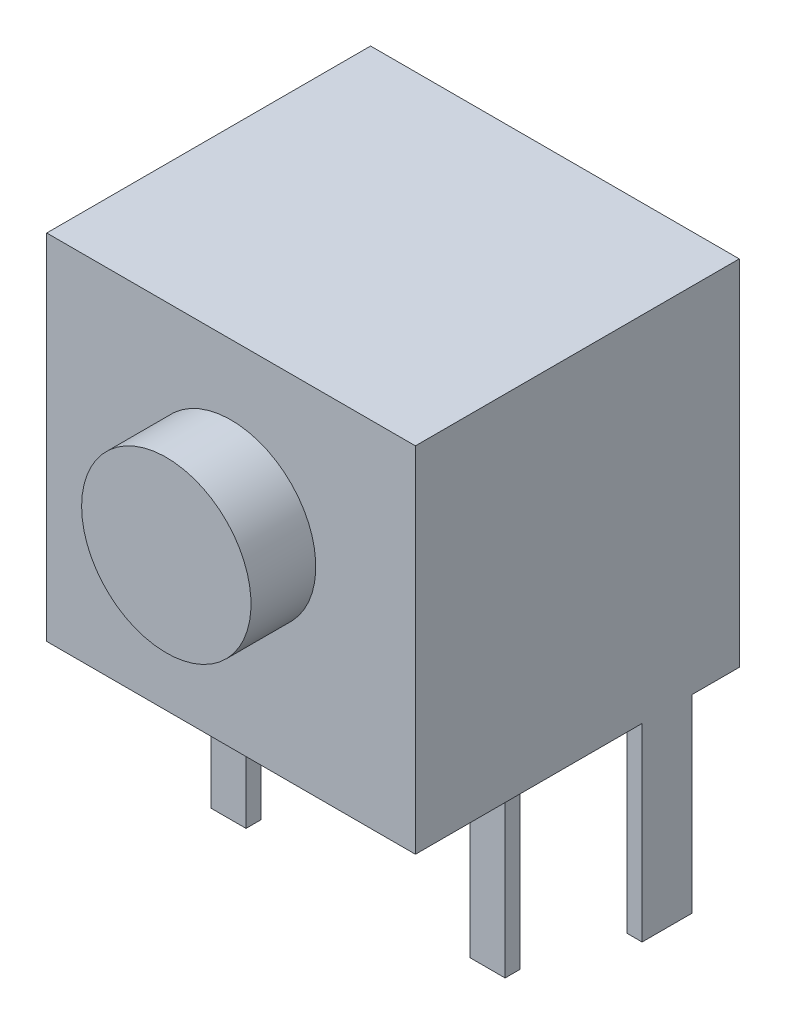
ISO-10303-21;
HEADER;
FILE_DESCRIPTION(('STEP AP214'),'2;1');
FILE_NAME('part.step','',(''),(''),'','','');
FILE_SCHEMA(('AUTOMOTIVE_DESIGN { 1 0 10303 214 1 1 1 1 }'));
ENDSEC;
DATA;
#1=APPLICATION_CONTEXT('core data for automotive mechanical design processes');
#2=APPLICATION_PROTOCOL_DEFINITION('international standard','automotive_design',2000,#1);
#3=PRODUCT_CONTEXT('',#1,'mechanical');
#4=PRODUCT('Part','Part','',(#3));
#5=PRODUCT_RELATED_PRODUCT_CATEGORY('part','',(#4));
#6=PRODUCT_DEFINITION_FORMATION('','',#4);
#7=PRODUCT_DEFINITION_CONTEXT('part definition',#1,'design');
#8=PRODUCT_DEFINITION('design','',#6,#7);
#9=PRODUCT_DEFINITION_SHAPE('','',#8);
#10=(LENGTH_UNIT() NAMED_UNIT(*) SI_UNIT(.MILLI.,.METRE.));
#11=(NAMED_UNIT(*) PLANE_ANGLE_UNIT() SI_UNIT($,.RADIAN.));
#12=(NAMED_UNIT(*) SI_UNIT($,.STERADIAN.) SOLID_ANGLE_UNIT());
#13=UNCERTAINTY_MEASURE_WITH_UNIT(LENGTH_MEASURE(1.E-05),#10,'distance_accuracy_value','');
#14=(GEOMETRIC_REPRESENTATION_CONTEXT(3) GLOBAL_UNCERTAINTY_ASSIGNED_CONTEXT((#13)) GLOBAL_UNIT_ASSIGNED_CONTEXT((#10,
#11,#12)) REPRESENTATION_CONTEXT('',''));
#15=CARTESIAN_POINT('',(0.,0.,0.));
#16=DIRECTION('',(0.,0.,1.));
#17=DIRECTION('',(1.,0.,0.));
#18=AXIS2_PLACEMENT_3D('',#15,#16,#17);
#19=CARTESIAN_POINT('',(-2.24999999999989,-7.35000000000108,-2.54999999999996));
#20=DIRECTION('',(0.,0.,-1.));
#21=DIRECTION('',(-1.,0.,0.));
#22=AXIS2_PLACEMENT_3D('',#19,#20,#21);
#23=PLANE('',#22);
#24=DIRECTION('',(0.,1.,0.));
#25=VECTOR('',#24,1.);
#26=CARTESIAN_POINT('',(-2.24999999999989,-7.35000000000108,-2.54999999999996));
#27=LINE('',#26,#25);
#28=CARTESIAN_POINT('',(-2.24999999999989,-7.35000000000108,-2.54999999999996));
#29=VERTEX_POINT('',#28);
#30=CARTESIAN_POINT('',(-2.24999999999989,-3.55000000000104,-2.54999999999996));
#31=VERTEX_POINT('',#30);
#32=EDGE_CURVE('E167',#29,#31,#27,.T.);
#33=ORIENTED_EDGE('',*,*,#32,.T.);
#34=DIRECTION('',(-1.,0.,0.));
#35=VECTOR('',#34,1.);
#36=CARTESIAN_POINT('',(-2.24999999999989,-3.55000000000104,-2.54999999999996));
#37=LINE('',#36,#35);
#38=CARTESIAN_POINT('',(-2.9500000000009,-3.55000000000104,-2.54999999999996));
#39=VERTEX_POINT('',#38);
#40=EDGE_CURVE('E151',#39,#31,#37,.F.);
#41=ORIENTED_EDGE('',*,*,#40,.F.);
#42=DIRECTION('',(0.,1.,0.));
#43=VECTOR('',#42,1.);
#44=CARTESIAN_POINT('',(-2.9500000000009,-7.35000000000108,-2.54999999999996));
#45=LINE('',#44,#43);
#46=CARTESIAN_POINT('',(-2.9500000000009,-7.35000000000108,-2.54999999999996));
#47=VERTEX_POINT('',#46);
#48=EDGE_CURVE('E253',#39,#47,#45,.F.);
#49=ORIENTED_EDGE('',*,*,#48,.T.);
#50=DIRECTION('',(-1.,0.,0.));
#51=VECTOR('',#50,1.);
#52=CARTESIAN_POINT('',(-2.24999999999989,-7.35000000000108,-2.54999999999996));
#53=LINE('',#52,#51);
#54=EDGE_CURVE('E161',#29,#47,#53,.T.);
#55=ORIENTED_EDGE('',*,*,#54,.F.);
#56=EDGE_LOOP('',(#33,#41,#49,#55));
#57=FACE_BOUND('',#56,.T.);
#58=ADVANCED_FACE('F17',(#57),#23,.F.);
#59=CARTESIAN_POINT('',(2.9500000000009,-7.35000000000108,-2.54999999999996));
#60=DIRECTION('',(0.,0.,-1.));
#61=DIRECTION('',(-1.,0.,0.));
#62=AXIS2_PLACEMENT_3D('',#59,#60,#61);
#63=PLANE('',#62);
#64=DIRECTION('',(0.,1.,0.));
#65=VECTOR('',#64,1.);
#66=CARTESIAN_POINT('',(2.9500000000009,-7.35000000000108,-2.54999999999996));
#67=LINE('',#66,#65);
#68=CARTESIAN_POINT('',(2.9500000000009,-7.35000000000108,-2.54999999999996));
#69=VERTEX_POINT('',#68);
#70=CARTESIAN_POINT('',(2.9500000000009,-3.55000000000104,-2.54999999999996));
#71=VERTEX_POINT('',#70);
#72=EDGE_CURVE('E245',#69,#71,#67,.T.);
#73=ORIENTED_EDGE('',*,*,#72,.T.);
#74=DIRECTION('',(-1.,0.,0.));
#75=VECTOR('',#74,1.);
#76=CARTESIAN_POINT('',(2.9500000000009,-3.55000000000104,-2.54999999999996));
#77=LINE('',#76,#75);
#78=CARTESIAN_POINT('',(2.24999999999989,-3.55000000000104,-2.54999999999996));
#79=VERTEX_POINT('',#78);
#80=EDGE_CURVE('E179',#79,#71,#77,.F.);
#81=ORIENTED_EDGE('',*,*,#80,.F.);
#82=DIRECTION('',(0.,1.,0.));
#83=VECTOR('',#82,1.);
#84=CARTESIAN_POINT('',(2.24999999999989,-7.35000000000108,-2.54999999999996));
#85=LINE('',#84,#83);
#86=CARTESIAN_POINT('',(2.24999999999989,-7.35000000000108,-2.54999999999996));
#87=VERTEX_POINT('',#86);
#88=EDGE_CURVE('E237',#79,#87,#85,.F.);
#89=ORIENTED_EDGE('',*,*,#88,.T.);
#90=DIRECTION('',(-1.,0.,0.));
#91=VECTOR('',#90,1.);
#92=CARTESIAN_POINT('',(2.9500000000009,-7.35000000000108,-2.54999999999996));
#93=LINE('',#92,#91);
#94=EDGE_CURVE('E174',#69,#87,#93,.T.);
#95=ORIENTED_EDGE('',*,*,#94,.F.);
#96=EDGE_LOOP('',(#73,#81,#89,#95));
#97=FACE_BOUND('',#96,.T.);
#98=ADVANCED_FACE('F428',(#97),#63,.F.);
#99=CARTESIAN_POINT('',(0.,0.449999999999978,1.29999999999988));
#100=DIRECTION('',(0.,0.,1.));
#101=DIRECTION('',(1.,0.,0.));
#102=AXIS2_PLACEMENT_3D('',#99,#100,#101);
#103=PLANE('',#102);
#104=CARTESIAN_POINT('',(0.,0.449999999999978,1.29999999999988));
#105=DIRECTION('',(0.,0.,-1.));
#106=DIRECTION('',(-1.,0.,0.));
#107=AXIS2_PLACEMENT_3D('',#104,#105,#106);
#108=CIRCLE('',#107,1.70000000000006);
#109=CARTESIAN_POINT('',(-1.70000000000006,0.449999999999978,1.29999999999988));
#110=VERTEX_POINT('',#109);
#111=EDGE_CURVE('E20',#110,#110,#108,.T.);
#112=ORIENTED_EDGE('',*,*,#111,.F.);
#113=EDGE_LOOP('',(#112));
#114=FACE_BOUND('',#113,.T.);
#115=ADVANCED_FACE('F425',(#114),#103,.T.);
#116=CARTESIAN_POINT('',(-3.3999999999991,-7.35000000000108,-4.54999999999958));
#117=DIRECTION('',(-1.,0.,0.));
#118=DIRECTION('',(0.,0.,1.));
#119=AXIS2_PLACEMENT_3D('',#116,#117,#118);
#120=PLANE('',#119);
#121=DIRECTION('',(0.,1.,0.));
#122=VECTOR('',#121,1.);
#123=CARTESIAN_POINT('',(-3.3999999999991,-7.35000000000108,-5.55000000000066));
#124=LINE('',#123,#122);
#125=CARTESIAN_POINT('',(-3.3999999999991,-7.35000000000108,-5.55000000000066));
#126=VERTEX_POINT('',#125);
#127=CARTESIAN_POINT('',(-3.3999999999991,-3.55000000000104,-5.55000000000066));
#128=VERTEX_POINT('',#127);
#129=EDGE_CURVE('E226',#126,#128,#124,.T.);
#130=ORIENTED_EDGE('',*,*,#129,.T.);
#131=DIRECTION('',(0.,0.,1.));
#132=VECTOR('',#131,1.);
#133=CARTESIAN_POINT('',(-3.3999999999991,-3.55000000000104,-4.54999999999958));
#134=LINE('',#133,#132);
#135=CARTESIAN_POINT('',(-3.3999999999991,-3.55000000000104,-4.54999999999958));
#136=VERTEX_POINT('',#135);
#137=EDGE_CURVE('E172',#136,#128,#134,.F.);
#138=ORIENTED_EDGE('',*,*,#137,.F.);
#139=DIRECTION('',(0.,1.,0.));
#140=VECTOR('',#139,1.);
#141=CARTESIAN_POINT('',(-3.3999999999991,-7.35000000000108,-4.54999999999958));
#142=LINE('',#141,#140);
#143=CARTESIAN_POINT('',(-3.3999999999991,-7.35000000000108,-4.54999999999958));
#144=VERTEX_POINT('',#143);
#145=EDGE_CURVE('E213',#136,#144,#142,.F.);
#146=ORIENTED_EDGE('',*,*,#145,.T.);
#147=DIRECTION('',(0.,0.,-1.));
#148=VECTOR('',#147,1.);
#149=CARTESIAN_POINT('',(-3.3999999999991,-7.35000000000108,-5.55000000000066));
#150=LINE('',#149,#148);
#151=EDGE_CURVE('E219',#126,#144,#150,.F.);
#152=ORIENTED_EDGE('',*,*,#151,.F.);
#153=EDGE_LOOP('',(#130,#138,#146,#152));
#154=FACE_BOUND('',#153,.T.);
#155=ADVANCED_FACE('F422',(#154),#120,.F.);
#156=CARTESIAN_POINT('',(-2.24999999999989,-7.35000000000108,-2.54999999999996));
#157=DIRECTION('',(-1.,0.,0.));
#158=DIRECTION('',(0.,0.,1.));
#159=AXIS2_PLACEMENT_3D('',#156,#157,#158);
#160=PLANE('',#159);
#161=DIRECTION('',(0.,1.,0.));
#162=VECTOR('',#161,1.);
#163=CARTESIAN_POINT('',(-2.24999999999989,-7.35000000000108,-2.84999999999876));
#164=LINE('',#163,#162);
#165=CARTESIAN_POINT('',(-2.24999999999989,-7.35000000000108,-2.84999999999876));
#166=VERTEX_POINT('',#165);
#167=CARTESIAN_POINT('',(-2.24999999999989,-3.55000000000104,-2.84999999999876));
#168=VERTEX_POINT('',#167);
#169=EDGE_CURVE('E169',#166,#168,#164,.T.);
#170=ORIENTED_EDGE('',*,*,#169,.T.);
#171=DIRECTION('',(0.,0.,1.));
#172=VECTOR('',#171,1.);
#173=CARTESIAN_POINT('',(-2.24999999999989,-3.55000000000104,-2.54999999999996));
#174=LINE('',#173,#172);
#175=EDGE_CURVE('E158',#31,#168,#174,.F.);
#176=ORIENTED_EDGE('',*,*,#175,.F.);
#177=ORIENTED_EDGE('',*,*,#32,.F.);
#178=DIRECTION('',(0.,0.,1.));
#179=VECTOR('',#178,1.);
#180=CARTESIAN_POINT('',(-2.24999999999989,-7.35000000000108,-2.84999999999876));
#181=LINE('',#180,#179);
#182=EDGE_CURVE('E251',#29,#166,#181,.F.);
#183=ORIENTED_EDGE('',*,*,#182,.T.);
#184=EDGE_LOOP('',(#170,#176,#177,#183));
#185=FACE_BOUND('',#184,.T.);
#186=ADVANCED_FACE('F165',(#185),#160,.F.);
#187=CARTESIAN_POINT('',(-2.9500000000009,-7.35000000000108,-2.54999999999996));
#188=DIRECTION('',(1.,0.,0.));
#189=DIRECTION('',(0.,0.,-1.));
#190=AXIS2_PLACEMENT_3D('',#187,#188,#189);
#191=PLANE('',#190);
#192=ORIENTED_EDGE('',*,*,#48,.F.);
#193=DIRECTION('',(0.,0.,-1.));
#194=VECTOR('',#193,1.);
#195=CARTESIAN_POINT('',(-2.9500000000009,-3.55000000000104,-2.54999999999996));
#196=LINE('',#195,#194);
#197=CARTESIAN_POINT('',(-2.9500000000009,-3.55000000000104,-2.84999999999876));
#198=VERTEX_POINT('',#197);
#199=EDGE_CURVE('E160',#198,#39,#196,.F.);
#200=ORIENTED_EDGE('',*,*,#199,.F.);
#201=DIRECTION('',(0.,1.,0.));
#202=VECTOR('',#201,1.);
#203=CARTESIAN_POINT('',(-2.9500000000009,-7.35000000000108,-2.84999999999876));
#204=LINE('',#203,#202);
#205=CARTESIAN_POINT('',(-2.9500000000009,-7.35000000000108,-2.84999999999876));
#206=VERTEX_POINT('',#205);
#207=EDGE_CURVE('E206',#198,#206,#204,.F.);
#208=ORIENTED_EDGE('',*,*,#207,.T.);
#209=DIRECTION('',(0.,0.,1.));
#210=VECTOR('',#209,1.);
#211=CARTESIAN_POINT('',(-2.9500000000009,-7.35000000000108,-2.84999999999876));
#212=LINE('',#211,#210);
#213=EDGE_CURVE('E248',#206,#47,#212,.T.);
#214=ORIENTED_EDGE('',*,*,#213,.T.);
#215=EDGE_LOOP('',(#192,#200,#208,#214));
#216=FACE_BOUND('',#215,.T.);
#217=ADVANCED_FACE('F255',(#216),#191,.F.);
#218=CARTESIAN_POINT('',(-2.24999999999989,-7.35000000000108,-2.84999999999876));
#219=DIRECTION('',(0.,1.,0.));
#220=DIRECTION('',(0.,0.,1.));
#221=AXIS2_PLACEMENT_3D('',#218,#219,#220);
#222=PLANE('',#221);
#223=DIRECTION('',(1.,0.,0.));
#224=VECTOR('',#223,1.);
#225=CARTESIAN_POINT('',(-2.24999999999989,-7.35000000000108,-2.84999999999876));
#226=LINE('',#225,#224);
#227=EDGE_CURVE('E203',#206,#166,#226,.T.);
#228=ORIENTED_EDGE('',*,*,#227,.T.);
#229=ORIENTED_EDGE('',*,*,#182,.F.);
#230=ORIENTED_EDGE('',*,*,#54,.T.);
#231=ORIENTED_EDGE('',*,*,#213,.F.);
#232=EDGE_LOOP('',(#228,#229,#230,#231));
#233=FACE_BOUND('',#232,.T.);
#234=ADVANCED_FACE('F259',(#233),#222,.F.);
#235=CARTESIAN_POINT('',(2.9500000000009,-7.35000000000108,-2.54999999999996));
#236=DIRECTION('',(-1.,0.,0.));
#237=DIRECTION('',(0.,0.,1.));
#238=AXIS2_PLACEMENT_3D('',#235,#236,#237);
#239=PLANE('',#238);
#240=DIRECTION('',(0.,1.,0.));
#241=VECTOR('',#240,1.);
#242=CARTESIAN_POINT('',(2.9500000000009,-7.35000000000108,-2.84999999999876));
#243=LINE('',#242,#241);
#244=CARTESIAN_POINT('',(2.9500000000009,-7.35000000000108,-2.84999999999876));
#245=VERTEX_POINT('',#244);
#246=CARTESIAN_POINT('',(2.9500000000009,-3.55000000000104,-2.84999999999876));
#247=VERTEX_POINT('',#246);
#248=EDGE_CURVE('E197',#245,#247,#243,.T.);
#249=ORIENTED_EDGE('',*,*,#248,.T.);
#250=DIRECTION('',(0.,0.,1.));
#251=VECTOR('',#250,1.);
#252=CARTESIAN_POINT('',(2.9500000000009,-3.55000000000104,-2.54999999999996));
#253=LINE('',#252,#251);
#254=EDGE_CURVE('E243',#71,#247,#253,.F.);
#255=ORIENTED_EDGE('',*,*,#254,.F.);
#256=ORIENTED_EDGE('',*,*,#72,.F.);
#257=DIRECTION('',(0.,0.,1.));
#258=VECTOR('',#257,1.);
#259=CARTESIAN_POINT('',(2.9500000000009,-7.35000000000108,-2.84999999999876));
#260=LINE('',#259,#258);
#261=EDGE_CURVE('E234',#69,#245,#260,.F.);
#262=ORIENTED_EDGE('',*,*,#261,.T.);
#263=EDGE_LOOP('',(#249,#255,#256,#262));
#264=FACE_BOUND('',#263,.T.);
#265=ADVANCED_FACE('F411',(#264),#239,.F.);
#266=CARTESIAN_POINT('',(2.24999999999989,-7.35000000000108,-2.54999999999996));
#267=DIRECTION('',(1.,0.,0.));
#268=DIRECTION('',(0.,0.,-1.));
#269=AXIS2_PLACEMENT_3D('',#266,#267,#268);
#270=PLANE('',#269);
#271=ORIENTED_EDGE('',*,*,#88,.F.);
#272=DIRECTION('',(0.,0.,-1.));
#273=VECTOR('',#272,1.);
#274=CARTESIAN_POINT('',(2.24999999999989,-3.55000000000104,-2.54999999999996));
#275=LINE('',#274,#273);
#276=CARTESIAN_POINT('',(2.24999999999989,-3.55000000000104,-2.84999999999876));
#277=VERTEX_POINT('',#276);
#278=EDGE_CURVE('E240',#277,#79,#275,.F.);
#279=ORIENTED_EDGE('',*,*,#278,.F.);
#280=DIRECTION('',(0.,1.,0.));
#281=VECTOR('',#280,1.);
#282=CARTESIAN_POINT('',(2.24999999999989,-7.35000000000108,-2.84999999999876));
#283=LINE('',#282,#281);
#284=CARTESIAN_POINT('',(2.24999999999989,-7.35000000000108,-2.84999999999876));
#285=VERTEX_POINT('',#284);
#286=EDGE_CURVE('E191',#277,#285,#283,.F.);
#287=ORIENTED_EDGE('',*,*,#286,.T.);
#288=DIRECTION('',(0.,0.,1.));
#289=VECTOR('',#288,1.);
#290=CARTESIAN_POINT('',(2.24999999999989,-7.35000000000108,-2.84999999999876));
#291=LINE('',#290,#289);
#292=EDGE_CURVE('E231',#285,#87,#291,.T.);
#293=ORIENTED_EDGE('',*,*,#292,.T.);
#294=EDGE_LOOP('',(#271,#279,#287,#293));
#295=FACE_BOUND('',#294,.T.);
#296=ADVANCED_FACE('F408',(#295),#270,.F.);
#297=CARTESIAN_POINT('',(2.9500000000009,-7.35000000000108,-2.84999999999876));
#298=DIRECTION('',(0.,1.,0.));
#299=DIRECTION('',(0.,0.,1.));
#300=AXIS2_PLACEMENT_3D('',#297,#298,#299);
#301=PLANE('',#300);
#302=DIRECTION('',(1.,0.,0.));
#303=VECTOR('',#302,1.);
#304=CARTESIAN_POINT('',(2.9500000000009,-7.35000000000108,-2.84999999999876));
#305=LINE('',#304,#303);
#306=EDGE_CURVE('E184',#285,#245,#305,.T.);
#307=ORIENTED_EDGE('',*,*,#306,.T.);
#308=ORIENTED_EDGE('',*,*,#261,.F.);
#309=ORIENTED_EDGE('',*,*,#94,.T.);
#310=ORIENTED_EDGE('',*,*,#292,.F.);
#311=EDGE_LOOP('',(#307,#308,#309,#310));
#312=FACE_BOUND('',#311,.T.);
#313=ADVANCED_FACE('F404',(#312),#301,.F.);
#314=CARTESIAN_POINT('',(0.,0.449999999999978,1.29999999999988));
#315=DIRECTION('',(0.,0.,-1.));
#316=DIRECTION('',(-1.,0.,0.));
#317=AXIS2_PLACEMENT_3D('',#314,#315,#316);
#318=CYLINDRICAL_SURFACE('',#317,1.70000000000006);
#319=ORIENTED_EDGE('',*,*,#111,.T.);
#320=EDGE_LOOP('',(#319));
#321=FACE_BOUND('',#320,.T.);
#322=CARTESIAN_POINT('',(0.,0.449999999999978,0.));
#323=DIRECTION('',(0.,0.,-1.));
#324=DIRECTION('',(-1.,0.,0.));
#325=AXIS2_PLACEMENT_3D('',#322,#323,#324);
#326=CIRCLE('',#325,1.70000000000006);
#327=CARTESIAN_POINT('',(-1.70000000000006,0.449999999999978,0.));
#328=VERTEX_POINT('',#327);
#329=EDGE_CURVE('E181',#328,#328,#326,.T.);
#330=ORIENTED_EDGE('',*,*,#329,.F.);
#331=EDGE_LOOP('',(#330));
#332=FACE_BOUND('',#331,.T.);
#333=ADVANCED_FACE('F400',(#321,#332),#318,.T.);
#334=CARTESIAN_POINT('',(3.3999999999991,-7.35000000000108,-4.54999999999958));
#335=DIRECTION('',(1.,0.,0.));
#336=DIRECTION('',(0.,0.,-1.));
#337=AXIS2_PLACEMENT_3D('',#334,#335,#336);
#338=PLANE('',#337);
#339=DIRECTION('',(0.,1.,0.));
#340=VECTOR('',#339,1.);
#341=CARTESIAN_POINT('',(3.3999999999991,-7.35000000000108,-4.54999999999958));
#342=LINE('',#341,#340);
#343=CARTESIAN_POINT('',(3.3999999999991,-7.35000000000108,-4.54999999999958));
#344=VERTEX_POINT('',#343);
#345=CARTESIAN_POINT('',(3.3999999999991,-3.55000000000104,-4.54999999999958));
#346=VERTEX_POINT('',#345);
#347=EDGE_CURVE('E183',#344,#346,#342,.T.);
#348=ORIENTED_EDGE('',*,*,#347,.T.);
#349=DIRECTION('',(0.,0.,-1.));
#350=VECTOR('',#349,1.);
#351=CARTESIAN_POINT('',(3.3999999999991,-3.55000000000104,-4.54999999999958));
#352=LINE('',#351,#350);
#353=CARTESIAN_POINT('',(3.3999999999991,-3.55000000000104,-5.55000000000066));
#354=VERTEX_POINT('',#353);
#355=EDGE_CURVE('E229',#354,#346,#352,.F.);
#356=ORIENTED_EDGE('',*,*,#355,.F.);
#357=DIRECTION('',(0.,1.,0.));
#358=VECTOR('',#357,1.);
#359=CARTESIAN_POINT('',(3.3999999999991,-7.35000000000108,-5.55000000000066));
#360=LINE('',#359,#358);
#361=CARTESIAN_POINT('',(3.3999999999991,-7.35000000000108,-5.55000000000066));
#362=VERTEX_POINT('',#361);
#363=EDGE_CURVE('E286',#354,#362,#360,.F.);
#364=ORIENTED_EDGE('',*,*,#363,.T.);
#365=DIRECTION('',(0.,0.,1.));
#366=VECTOR('',#365,1.);
#367=CARTESIAN_POINT('',(3.3999999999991,-7.35000000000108,-5.55000000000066));
#368=LINE('',#367,#366);
#369=EDGE_CURVE('E289',#362,#344,#368,.T.);
#370=ORIENTED_EDGE('',*,*,#369,.T.);
#371=EDGE_LOOP('',(#348,#356,#364,#370));
#372=FACE_BOUND('',#371,.T.);
#373=ADVANCED_FACE('F396',(#372),#338,.F.);
#374=CARTESIAN_POINT('',(-3.70000000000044,-7.35000000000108,-5.55000000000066));
#375=DIRECTION('',(0.,0.,1.));
#376=DIRECTION('',(1.,0.,0.));
#377=AXIS2_PLACEMENT_3D('',#374,#375,#376);
#378=PLANE('',#377);
#379=DIRECTION('',(0.,1.,0.));
#380=VECTOR('',#379,1.);
#381=CARTESIAN_POINT('',(-3.70000000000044,3.55000000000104,-5.55000000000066));
#382=LINE('',#381,#380);
#383=CARTESIAN_POINT('',(-3.70000000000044,-3.55000000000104,-5.55000000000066));
#384=VERTEX_POINT('',#383);
#385=CARTESIAN_POINT('',(-3.70000000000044,-7.35000000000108,-5.55000000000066));
#386=VERTEX_POINT('',#385);
#387=EDGE_CURVE('E275',#384,#386,#382,.F.);
#388=ORIENTED_EDGE('',*,*,#387,.F.);
#389=DIRECTION('',(1.,0.,0.));
#390=VECTOR('',#389,1.);
#391=CARTESIAN_POINT('',(-3.70000000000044,-3.55000000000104,-5.55000000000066));
#392=LINE('',#391,#390);
#393=EDGE_CURVE('E224',#128,#384,#392,.F.);
#394=ORIENTED_EDGE('',*,*,#393,.F.);
#395=ORIENTED_EDGE('',*,*,#129,.F.);
#396=DIRECTION('',(1.,0.,0.));
#397=VECTOR('',#396,1.);
#398=CARTESIAN_POINT('',(-3.70000000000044,-7.35000000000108,-5.55000000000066));
#399=LINE('',#398,#397);
#400=EDGE_CURVE('E221',#386,#126,#399,.T.);
#401=ORIENTED_EDGE('',*,*,#400,.F.);
#402=EDGE_LOOP('',(#388,#394,#395,#401));
#403=FACE_BOUND('',#402,.T.);
#404=ADVANCED_FACE('F392',(#403),#378,.F.);
#405=CARTESIAN_POINT('',(-3.70000000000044,-7.35000000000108,-5.55000000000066));
#406=DIRECTION('',(0.,-1.,0.));
#407=DIRECTION('',(0.,0.,-1.));
#408=AXIS2_PLACEMENT_3D('',#405,#406,#407);
#409=PLANE('',#408);
#410=ORIENTED_EDGE('',*,*,#400,.T.);
#411=ORIENTED_EDGE('',*,*,#151,.T.);
#412=DIRECTION('',(-1.,0.,0.));
#413=VECTOR('',#412,1.);
#414=CARTESIAN_POINT('',(-3.70000000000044,-7.35000000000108,-4.54999999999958));
#415=LINE('',#414,#413);
#416=CARTESIAN_POINT('',(-3.70000000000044,-7.35000000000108,-4.54999999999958));
#417=VERTEX_POINT('',#416);
#418=EDGE_CURVE('E210',#144,#417,#415,.T.);
#419=ORIENTED_EDGE('',*,*,#418,.T.);
#420=DIRECTION('',(0.,0.,1.));
#421=VECTOR('',#420,1.);
#422=CARTESIAN_POINT('',(-3.70000000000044,-7.35000000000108,-6.4999999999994));
#423=LINE('',#422,#421);
#424=EDGE_CURVE('E270',#386,#417,#423,.T.);
#425=ORIENTED_EDGE('',*,*,#424,.F.);
#426=EDGE_LOOP('',(#410,#411,#419,#425));
#427=FACE_BOUND('',#426,.T.);
#428=ADVANCED_FACE('F388',(#427),#409,.T.);
#429=CARTESIAN_POINT('',(-3.70000000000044,-7.35000000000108,-4.54999999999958));
#430=DIRECTION('',(0.,0.,-1.));
#431=DIRECTION('',(-1.,0.,0.));
#432=AXIS2_PLACEMENT_3D('',#429,#430,#431);
#433=PLANE('',#432);
#434=ORIENTED_EDGE('',*,*,#145,.F.);
#435=DIRECTION('',(-1.,0.,0.));
#436=VECTOR('',#435,1.);
#437=CARTESIAN_POINT('',(-3.70000000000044,-3.55000000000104,-4.54999999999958));
#438=LINE('',#437,#436);
#439=CARTESIAN_POINT('',(-3.70000000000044,-3.55000000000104,-4.54999999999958));
#440=VERTEX_POINT('',#439);
#441=EDGE_CURVE('E216',#440,#136,#438,.F.);
#442=ORIENTED_EDGE('',*,*,#441,.F.);
#443=DIRECTION('',(0.,1.,0.));
#444=VECTOR('',#443,1.);
#445=CARTESIAN_POINT('',(-3.70000000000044,3.55000000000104,-4.54999999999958));
#446=LINE('',#445,#444);
#447=EDGE_CURVE('E264',#417,#440,#446,.T.);
#448=ORIENTED_EDGE('',*,*,#447,.F.);
#449=ORIENTED_EDGE('',*,*,#418,.F.);
#450=EDGE_LOOP('',(#434,#442,#448,#449));
#451=FACE_BOUND('',#450,.T.);
#452=ADVANCED_FACE('F385',(#451),#433,.F.);
#453=CARTESIAN_POINT('',(-2.24999999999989,-7.35000000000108,-2.84999999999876));
#454=DIRECTION('',(0.,0.,1.));
#455=DIRECTION('',(1.,0.,0.));
#456=AXIS2_PLACEMENT_3D('',#453,#454,#455);
#457=PLANE('',#456);
#458=ORIENTED_EDGE('',*,*,#207,.F.);
#459=DIRECTION('',(1.,0.,0.));
#460=VECTOR('',#459,1.);
#461=CARTESIAN_POINT('',(-3.70000000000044,-3.55000000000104,-2.84999999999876));
#462=LINE('',#461,#460);
#463=EDGE_CURVE('E262',#168,#198,#462,.F.);
#464=ORIENTED_EDGE('',*,*,#463,.F.);
#465=ORIENTED_EDGE('',*,*,#169,.F.);
#466=ORIENTED_EDGE('',*,*,#227,.F.);
#467=EDGE_LOOP('',(#458,#464,#465,#466));
#468=FACE_BOUND('',#467,.T.);
#469=ADVANCED_FACE('F261',(#468),#457,.F.);
#470=CARTESIAN_POINT('',(2.9500000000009,-7.35000000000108,-2.84999999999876));
#471=DIRECTION('',(0.,0.,1.));
#472=DIRECTION('',(1.,0.,0.));
#473=AXIS2_PLACEMENT_3D('',#470,#471,#472);
#474=PLANE('',#473);
#475=ORIENTED_EDGE('',*,*,#286,.F.);
#476=DIRECTION('',(1.,0.,0.));
#477=VECTOR('',#476,1.);
#478=CARTESIAN_POINT('',(-3.70000000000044,-3.55000000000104,-2.84999999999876));
#479=LINE('',#478,#477);
#480=EDGE_CURVE('E263',#247,#277,#479,.F.);
#481=ORIENTED_EDGE('',*,*,#480,.F.);
#482=ORIENTED_EDGE('',*,*,#248,.F.);
#483=ORIENTED_EDGE('',*,*,#306,.F.);
#484=EDGE_LOOP('',(#475,#481,#482,#483));
#485=FACE_BOUND('',#484,.T.);
#486=ADVANCED_FACE('F378',(#485),#474,.F.);
#487=CARTESIAN_POINT('',(-3.70000000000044,-3.55000000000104,0.));
#488=DIRECTION('',(0.,0.,1.));
#489=DIRECTION('',(1.,0.,0.));
#490=AXIS2_PLACEMENT_3D('',#487,#488,#489);
#491=PLANE('',#490);
#492=DIRECTION('',(1.,0.,0.));
#493=VECTOR('',#492,1.);
#494=CARTESIAN_POINT('',(-3.70000000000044,-3.55000000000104,0.));
#495=LINE('',#494,#493);
#496=CARTESIAN_POINT('',(3.70000000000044,-3.55000000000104,0.));
#497=VERTEX_POINT('',#496);
#498=CARTESIAN_POINT('',(-3.70000000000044,-3.55000000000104,0.));
#499=VERTEX_POINT('',#498);
#500=EDGE_CURVE('E321',#497,#499,#495,.F.);
#501=ORIENTED_EDGE('',*,*,#500,.F.);
#502=DIRECTION('',(0.,1.,0.));
#503=VECTOR('',#502,1.);
#504=CARTESIAN_POINT('',(3.70000000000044,3.55000000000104,0.));
#505=LINE('',#504,#503);
#506=CARTESIAN_POINT('',(3.70000000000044,3.55000000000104,0.));
#507=VERTEX_POINT('',#506);
#508=EDGE_CURVE('E313',#507,#497,#505,.F.);
#509=ORIENTED_EDGE('',*,*,#508,.F.);
#510=DIRECTION('',(1.,0.,0.));
#511=VECTOR('',#510,1.);
#512=CARTESIAN_POINT('',(-3.70000000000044,3.55000000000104,0.));
#513=LINE('',#512,#511);
#514=CARTESIAN_POINT('',(-3.70000000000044,3.55000000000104,0.));
#515=VERTEX_POINT('',#514);
#516=EDGE_CURVE('E281',#515,#507,#513,.T.);
#517=ORIENTED_EDGE('',*,*,#516,.F.);
#518=DIRECTION('',(0.,1.,0.));
#519=VECTOR('',#518,1.);
#520=CARTESIAN_POINT('',(-3.70000000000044,3.55000000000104,0.));
#521=LINE('',#520,#519);
#522=EDGE_CURVE('E279',#499,#515,#521,.T.);
#523=ORIENTED_EDGE('',*,*,#522,.F.);
#524=EDGE_LOOP('',(#501,#509,#517,#523));
#525=FACE_BOUND('',#524,.T.);
#526=ORIENTED_EDGE('',*,*,#329,.T.);
#527=EDGE_LOOP('',(#526));
#528=FACE_BOUND('',#527,.T.);
#529=ADVANCED_FACE('F375',(#525,#528),#491,.T.);
#530=CARTESIAN_POINT('',(3.70000000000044,-7.35000000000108,-4.54999999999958));
#531=DIRECTION('',(0.,0.,-1.));
#532=DIRECTION('',(-1.,0.,0.));
#533=AXIS2_PLACEMENT_3D('',#530,#531,#532);
#534=PLANE('',#533);
#535=DIRECTION('',(0.,1.,0.));
#536=VECTOR('',#535,1.);
#537=CARTESIAN_POINT('',(3.70000000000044,3.55000000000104,-4.54999999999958));
#538=LINE('',#537,#536);
#539=CARTESIAN_POINT('',(3.70000000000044,-3.55000000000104,-4.54999999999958));
#540=VERTEX_POINT('',#539);
#541=CARTESIAN_POINT('',(3.70000000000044,-7.35000000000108,-4.54999999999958));
#542=VERTEX_POINT('',#541);
#543=EDGE_CURVE('E298',#540,#542,#538,.F.);
#544=ORIENTED_EDGE('',*,*,#543,.F.);
#545=DIRECTION('',(1.,0.,0.));
#546=VECTOR('',#545,1.);
#547=CARTESIAN_POINT('',(-3.70000000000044,-3.55000000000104,-4.54999999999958));
#548=LINE('',#547,#546);
#549=EDGE_CURVE('E323',#346,#540,#548,.T.);
#550=ORIENTED_EDGE('',*,*,#549,.F.);
#551=ORIENTED_EDGE('',*,*,#347,.F.);
#552=DIRECTION('',(1.,0.,0.));
#553=VECTOR('',#552,1.);
#554=CARTESIAN_POINT('',(3.70000000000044,-7.35000000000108,-4.54999999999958));
#555=LINE('',#554,#553);
#556=EDGE_CURVE('E188',#344,#542,#555,.T.);
#557=ORIENTED_EDGE('',*,*,#556,.T.);
#558=EDGE_LOOP('',(#544,#550,#551,#557));
#559=FACE_BOUND('',#558,.T.);
#560=ADVANCED_FACE('F296',(#559),#534,.F.);
#561=CARTESIAN_POINT('',(3.70000000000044,-7.35000000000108,-5.55000000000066));
#562=DIRECTION('',(0.,1.,0.));
#563=DIRECTION('',(0.,0.,1.));
#564=AXIS2_PLACEMENT_3D('',#561,#562,#563);
#565=PLANE('',#564);
#566=DIRECTION('',(1.,0.,0.));
#567=VECTOR('',#566,1.);
#568=CARTESIAN_POINT('',(3.70000000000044,-7.35000000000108,-5.55000000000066));
#569=LINE('',#568,#567);
#570=CARTESIAN_POINT('',(3.70000000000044,-7.35000000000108,-5.55000000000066));
#571=VERTEX_POINT('',#570);
#572=EDGE_CURVE('E283',#362,#571,#569,.T.);
#573=ORIENTED_EDGE('',*,*,#572,.T.);
#574=DIRECTION('',(0.,0.,-1.));
#575=VECTOR('',#574,1.);
#576=CARTESIAN_POINT('',(3.70000000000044,-7.35000000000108,-6.4999999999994));
#577=LINE('',#576,#575);
#578=EDGE_CURVE('E300',#542,#571,#577,.T.);
#579=ORIENTED_EDGE('',*,*,#578,.F.);
#580=ORIENTED_EDGE('',*,*,#556,.F.);
#581=ORIENTED_EDGE('',*,*,#369,.F.);
#582=EDGE_LOOP('',(#573,#579,#580,#581));
#583=FACE_BOUND('',#582,.T.);
#584=ADVANCED_FACE('F301',(#583),#565,.F.);
#585=CARTESIAN_POINT('',(3.70000000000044,-7.35000000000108,-5.55000000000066));
#586=DIRECTION('',(0.,0.,1.));
#587=DIRECTION('',(1.,0.,0.));
#588=AXIS2_PLACEMENT_3D('',#585,#586,#587);
#589=PLANE('',#588);
#590=ORIENTED_EDGE('',*,*,#363,.F.);
#591=DIRECTION('',(1.,0.,0.));
#592=VECTOR('',#591,1.);
#593=CARTESIAN_POINT('',(-3.70000000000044,-3.55000000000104,-5.55000000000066));
#594=LINE('',#593,#592);
#595=CARTESIAN_POINT('',(3.70000000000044,-3.55000000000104,-5.55000000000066));
#596=VERTEX_POINT('',#595);
#597=EDGE_CURVE('E325',#596,#354,#594,.F.);
#598=ORIENTED_EDGE('',*,*,#597,.F.);
#599=DIRECTION('',(0.,1.,0.));
#600=VECTOR('',#599,1.);
#601=CARTESIAN_POINT('',(3.70000000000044,3.55000000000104,-5.55000000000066));
#602=LINE('',#601,#600);
#603=EDGE_CURVE('E304',#571,#596,#602,.T.);
#604=ORIENTED_EDGE('',*,*,#603,.F.);
#605=ORIENTED_EDGE('',*,*,#572,.F.);
#606=EDGE_LOOP('',(#590,#598,#604,#605));
#607=FACE_BOUND('',#606,.T.);
#608=ADVANCED_FACE('F367',(#607),#589,.F.);
#609=CARTESIAN_POINT('',(-3.70000000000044,3.55000000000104,-6.4999999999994));
#610=DIRECTION('',(0.,1.,0.));
#611=DIRECTION('',(0.,0.,1.));
#612=AXIS2_PLACEMENT_3D('',#609,#610,#611);
#613=PLANE('',#612);
#614=DIRECTION('',(0.,0.,-1.));
#615=VECTOR('',#614,1.);
#616=CARTESIAN_POINT('',(3.70000000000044,3.55000000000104,-6.4999999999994));
#617=LINE('',#616,#615);
#618=CARTESIAN_POINT('',(3.70000000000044,3.55000000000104,-6.4999999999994));
#619=VERTEX_POINT('',#618);
#620=EDGE_CURVE('E315',#619,#507,#617,.F.);
#621=ORIENTED_EDGE('',*,*,#620,.F.);
#622=DIRECTION('',(1.,0.,0.));
#623=VECTOR('',#622,1.);
#624=CARTESIAN_POINT('',(-3.70000000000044,3.55000000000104,-6.4999999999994));
#625=LINE('',#624,#623);
#626=CARTESIAN_POINT('',(-3.70000000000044,3.55000000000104,-6.4999999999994));
#627=VERTEX_POINT('',#626);
#628=EDGE_CURVE('E344',#619,#627,#625,.F.);
#629=ORIENTED_EDGE('',*,*,#628,.T.);
#630=DIRECTION('',(0.,0.,1.));
#631=VECTOR('',#630,1.);
#632=CARTESIAN_POINT('',(-3.70000000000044,3.55000000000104,-6.4999999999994));
#633=LINE('',#632,#631);
#634=EDGE_CURVE('E277',#515,#627,#633,.F.);
#635=ORIENTED_EDGE('',*,*,#634,.F.);
#636=ORIENTED_EDGE('',*,*,#516,.T.);
#637=EDGE_LOOP('',(#621,#629,#635,#636));
#638=FACE_BOUND('',#637,.T.);
#639=ADVANCED_FACE('F349',(#638),#613,.T.);
#640=CARTESIAN_POINT('',(-3.70000000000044,3.55000000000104,-6.4999999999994));
#641=DIRECTION('',(-1.,0.,0.));
#642=DIRECTION('',(0.,0.,1.));
#643=AXIS2_PLACEMENT_3D('',#640,#641,#642);
#644=PLANE('',#643);
#645=ORIENTED_EDGE('',*,*,#424,.T.);
#646=ORIENTED_EDGE('',*,*,#447,.T.);
#647=DIRECTION('',(0.,0.,-1.));
#648=VECTOR('',#647,1.);
#649=CARTESIAN_POINT('',(-3.70000000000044,-3.55000000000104,-6.4999999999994));
#650=LINE('',#649,#648);
#651=EDGE_CURVE('E318',#499,#440,#650,.T.);
#652=ORIENTED_EDGE('',*,*,#651,.F.);
#653=ORIENTED_EDGE('',*,*,#522,.T.);
#654=ORIENTED_EDGE('',*,*,#634,.T.);
#655=DIRECTION('',(0.,1.,0.));
#656=VECTOR('',#655,1.);
#657=CARTESIAN_POINT('',(-3.70000000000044,-3.55000000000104,-6.4999999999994));
#658=LINE('',#657,#656);
#659=CARTESIAN_POINT('',(-3.70000000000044,-3.55000000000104,-6.4999999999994));
#660=VERTEX_POINT('',#659);
#661=EDGE_CURVE('E339',#627,#660,#658,.F.);
#662=ORIENTED_EDGE('',*,*,#661,.T.);
#663=DIRECTION('',(0.,0.,-1.));
#664=VECTOR('',#663,1.);
#665=CARTESIAN_POINT('',(-3.70000000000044,-3.55000000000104,-6.4999999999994));
#666=LINE('',#665,#664);
#667=EDGE_CURVE('E267',#384,#660,#666,.T.);
#668=ORIENTED_EDGE('',*,*,#667,.F.);
#669=ORIENTED_EDGE('',*,*,#387,.T.);
#670=EDGE_LOOP('',(#645,#646,#652,#653,#654,#662,#668,#669));
#671=FACE_BOUND('',#670,.T.);
#672=ADVANCED_FACE('F342',(#671),#644,.T.);
#673=CARTESIAN_POINT('',(-3.70000000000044,-3.55000000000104,-6.4999999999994));
#674=DIRECTION('',(0.,-1.,0.));
#675=DIRECTION('',(0.,0.,-1.));
#676=AXIS2_PLACEMENT_3D('',#673,#674,#675);
#677=PLANE('',#676);
#678=ORIENTED_EDGE('',*,*,#500,.T.);
#679=ORIENTED_EDGE('',*,*,#651,.T.);
#680=ORIENTED_EDGE('',*,*,#441,.T.);
#681=ORIENTED_EDGE('',*,*,#137,.T.);
#682=ORIENTED_EDGE('',*,*,#393,.T.);
#683=ORIENTED_EDGE('',*,*,#667,.T.);
#684=DIRECTION('',(1.,0.,0.));
#685=VECTOR('',#684,1.);
#686=CARTESIAN_POINT('',(-3.70000000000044,-3.55000000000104,-6.4999999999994));
#687=LINE('',#686,#685);
#688=CARTESIAN_POINT('',(3.70000000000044,-3.55000000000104,-6.4999999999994));
#689=VERTEX_POINT('',#688);
#690=EDGE_CURVE('E26',#660,#689,#687,.T.);
#691=ORIENTED_EDGE('',*,*,#690,.T.);
#692=DIRECTION('',(0.,0.,-1.));
#693=VECTOR('',#692,1.);
#694=CARTESIAN_POINT('',(3.70000000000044,-3.55000000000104,-6.4999999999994));
#695=LINE('',#694,#693);
#696=EDGE_CURVE('E34',#596,#689,#695,.T.);
#697=ORIENTED_EDGE('',*,*,#696,.F.);
#698=ORIENTED_EDGE('',*,*,#597,.T.);
#699=ORIENTED_EDGE('',*,*,#355,.T.);
#700=ORIENTED_EDGE('',*,*,#549,.T.);
#701=DIRECTION('',(0.,0.,-1.));
#702=VECTOR('',#701,1.);
#703=CARTESIAN_POINT('',(3.70000000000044,-3.55000000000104,-6.4999999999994));
#704=LINE('',#703,#702);
#705=EDGE_CURVE('E307',#497,#540,#704,.T.);
#706=ORIENTED_EDGE('',*,*,#705,.F.);
#707=EDGE_LOOP('',(#678,#679,#680,#681,#682,#683,#691,#697,#698,#699,#700,#706));
#708=FACE_BOUND('',#707,.T.);
#709=ORIENTED_EDGE('',*,*,#254,.T.);
#710=ORIENTED_EDGE('',*,*,#480,.T.);
#711=ORIENTED_EDGE('',*,*,#278,.T.);
#712=ORIENTED_EDGE('',*,*,#80,.T.);
#713=EDGE_LOOP('',(#709,#710,#711,#712));
#714=FACE_BOUND('',#713,.T.);
#715=ORIENTED_EDGE('',*,*,#175,.T.);
#716=ORIENTED_EDGE('',*,*,#463,.T.);
#717=ORIENTED_EDGE('',*,*,#199,.T.);
#718=ORIENTED_EDGE('',*,*,#40,.T.);
#719=EDGE_LOOP('',(#715,#716,#717,#718));
#720=FACE_BOUND('',#719,.T.);
#721=ADVANCED_FACE('F156',(#708,#714,#720),#677,.T.);
#722=CARTESIAN_POINT('',(3.70000000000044,3.55000000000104,-6.4999999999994));
#723=DIRECTION('',(1.,0.,0.));
#724=DIRECTION('',(0.,0.,-1.));
#725=AXIS2_PLACEMENT_3D('',#722,#723,#724);
#726=PLANE('',#725);
#727=ORIENTED_EDGE('',*,*,#696,.T.);
#728=DIRECTION('',(0.,1.,0.));
#729=VECTOR('',#728,1.);
#730=CARTESIAN_POINT('',(3.70000000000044,-3.55000000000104,-6.4999999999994));
#731=LINE('',#730,#729);
#732=EDGE_CURVE('E11',#689,#619,#731,.T.);
#733=ORIENTED_EDGE('',*,*,#732,.T.);
#734=ORIENTED_EDGE('',*,*,#620,.T.);
#735=ORIENTED_EDGE('',*,*,#508,.T.);
#736=ORIENTED_EDGE('',*,*,#705,.T.);
#737=ORIENTED_EDGE('',*,*,#543,.T.);
#738=ORIENTED_EDGE('',*,*,#578,.T.);
#739=ORIENTED_EDGE('',*,*,#603,.T.);
#740=EDGE_LOOP('',(#727,#733,#734,#735,#736,#737,#738,#739));
#741=FACE_BOUND('',#740,.T.);
#742=ADVANCED_FACE('F352',(#741),#726,.T.);
#743=CARTESIAN_POINT('',(-3.70000000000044,-3.55000000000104,-6.4999999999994));
#744=DIRECTION('',(0.,0.,1.));
#745=DIRECTION('',(1.,0.,0.));
#746=AXIS2_PLACEMENT_3D('',#743,#744,#745);
#747=PLANE('',#746);
#748=ORIENTED_EDGE('',*,*,#690,.F.);
#749=ORIENTED_EDGE('',*,*,#661,.F.);
#750=ORIENTED_EDGE('',*,*,#628,.F.);
#751=ORIENTED_EDGE('',*,*,#732,.F.);
#752=EDGE_LOOP('',(#748,#749,#750,#751));
#753=FACE_BOUND('',#752,.T.);
#754=ADVANCED_FACE('F338',(#753),#747,.F.);
#755=CLOSED_SHELL('',(#58,#98,#115,#155,#186,#217,#234,#265,#296,#313,#333,#373,#404,#428,#452,
#469,#486,#529,#560,#584,#608,#639,#672,#721,#742,#754));
#756=MANIFOLD_SOLID_BREP('B1',#755);
#757=ADVANCED_BREP_SHAPE_REPRESENTATION('',(#18,#756),#14);
#758=SHAPE_DEFINITION_REPRESENTATION(#9,#757);
ENDSEC;
END-ISO-10303-21;
